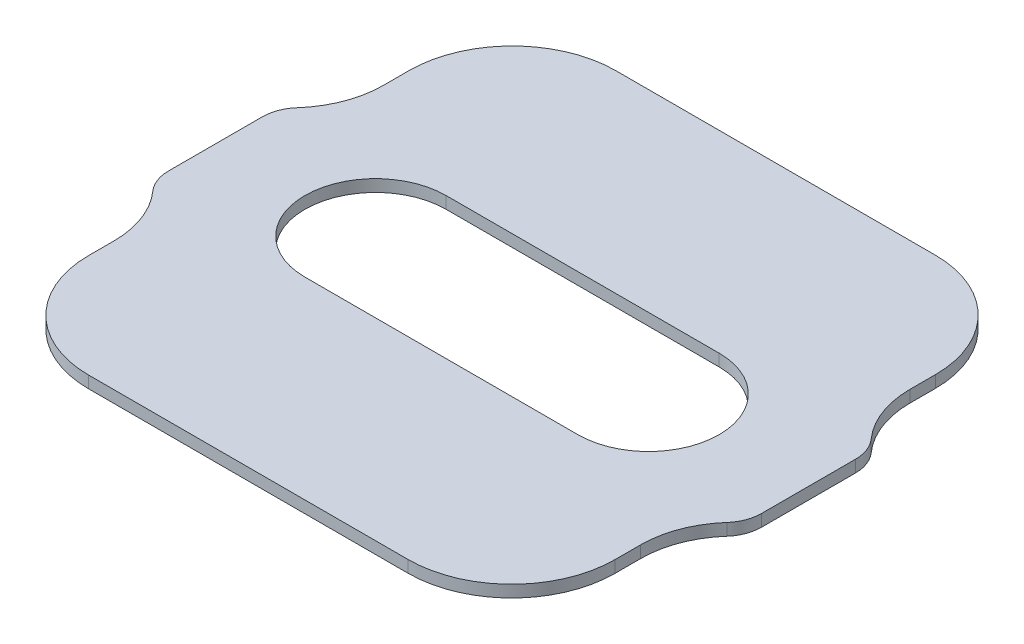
ISO-10303-21;
HEADER;
FILE_DESCRIPTION(('STEP AP214'),'2;1');
FILE_NAME('part.step','',(''),(''),'','','');
FILE_SCHEMA(('AUTOMOTIVE_DESIGN { 1 0 10303 214 1 1 1 1 }'));
ENDSEC;
DATA;
#1=APPLICATION_CONTEXT('core data for automotive mechanical design processes');
#2=APPLICATION_PROTOCOL_DEFINITION('international standard','automotive_design',2000,#1);
#3=PRODUCT_CONTEXT('',#1,'mechanical');
#4=PRODUCT('Part','Part','',(#3));
#5=PRODUCT_RELATED_PRODUCT_CATEGORY('part','',(#4));
#6=PRODUCT_DEFINITION_FORMATION('','',#4);
#7=PRODUCT_DEFINITION_CONTEXT('part definition',#1,'design');
#8=PRODUCT_DEFINITION('design','',#6,#7);
#9=PRODUCT_DEFINITION_SHAPE('','',#8);
#10=(LENGTH_UNIT() NAMED_UNIT(*) SI_UNIT(.MILLI.,.METRE.));
#11=(NAMED_UNIT(*) PLANE_ANGLE_UNIT() SI_UNIT($,.RADIAN.));
#12=(NAMED_UNIT(*) SI_UNIT($,.STERADIAN.) SOLID_ANGLE_UNIT());
#13=UNCERTAINTY_MEASURE_WITH_UNIT(LENGTH_MEASURE(1.E-05),#10,'distance_accuracy_value','');
#14=(GEOMETRIC_REPRESENTATION_CONTEXT(3) GLOBAL_UNCERTAINTY_ASSIGNED_CONTEXT((#13)) GLOBAL_UNIT_ASSIGNED_CONTEXT((#10,
#11,#12)) REPRESENTATION_CONTEXT('',''));
#15=CARTESIAN_POINT('',(0.,0.,0.));
#16=DIRECTION('',(0.,0.,1.));
#17=DIRECTION('',(1.,0.,0.));
#18=AXIS2_PLACEMENT_3D('',#15,#16,#17);
#19=CARTESIAN_POINT('',(16.1952754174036,0.127,5.33075165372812));
#20=DIRECTION('',(0.,-1.,0.));
#21=DIRECTION('',(0.,0.,-1.));
#22=AXIS2_PLACEMENT_3D('',#19,#20,#21);
#23=CYLINDRICAL_SURFACE('',#22,0.400000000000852);
#24=CARTESIAN_POINT('',(16.1952754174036,0.,5.33075165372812));
#25=DIRECTION('',(0.,1.,0.));
#26=DIRECTION('',(0.,0.,1.));
#27=AXIS2_PLACEMENT_3D('',#24,#25,#26);
#28=CIRCLE('',#27,0.400000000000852);
#29=CARTESIAN_POINT('',(15.8963417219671,0.,5.06497233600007));
#30=VERTEX_POINT('',#29);
#31=CARTESIAN_POINT('',(15.7952754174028,0.,5.33075165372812));
#32=VERTEX_POINT('',#31);
#33=EDGE_CURVE('E230',#30,#32,#28,.T.);
#34=ORIENTED_EDGE('',*,*,#33,.T.);
#35=DIRECTION('',(0.,-1.,0.));
#36=VECTOR('',#35,1.);
#37=CARTESIAN_POINT('',(15.7952754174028,0.127,5.33075165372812));
#38=LINE('',#37,#36);
#39=CARTESIAN_POINT('',(15.7952754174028,0.127,5.33075165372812));
#40=VERTEX_POINT('',#39);
#41=EDGE_CURVE('E11',#40,#32,#38,.T.);
#42=ORIENTED_EDGE('',*,*,#41,.F.);
#43=CARTESIAN_POINT('',(16.1952754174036,0.127,5.33075165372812));
#44=DIRECTION('',(0.,1.,0.));
#45=DIRECTION('',(0.,0.,1.));
#46=AXIS2_PLACEMENT_3D('',#43,#44,#45);
#47=CIRCLE('',#46,0.400000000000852);
#48=CARTESIAN_POINT('',(15.8963417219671,0.127,5.06497233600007));
#49=VERTEX_POINT('',#48);
#50=EDGE_CURVE('E234',#49,#40,#47,.T.);
#51=ORIENTED_EDGE('',*,*,#50,.F.);
#52=DIRECTION('',(0.,-1.,0.));
#53=VECTOR('',#52,1.);
#54=CARTESIAN_POINT('',(15.8963417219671,0.127,5.06497233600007));
#55=LINE('',#54,#53);
#56=EDGE_CURVE('E276',#49,#30,#55,.T.);
#57=ORIENTED_EDGE('',*,*,#56,.T.);
#58=EDGE_LOOP('',(#34,#42,#51,#57));
#59=FACE_BOUND('',#58,.T.);
#60=ADVANCED_FACE('F37',(#59),#23,.T.);
#61=CARTESIAN_POINT('',(15.7952754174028,0.127,5.33075165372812));
#62=DIRECTION('',(1.,0.,0.));
#63=DIRECTION('',(0.,0.,-1.));
#64=AXIS2_PLACEMENT_3D('',#61,#62,#63);
#65=PLANE('',#64);
#66=DIRECTION('',(0.,0.,1.));
#67=VECTOR('',#66,1.);
#68=CARTESIAN_POINT('',(15.7952754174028,0.,5.33075165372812));
#69=LINE('',#68,#67);
#70=CARTESIAN_POINT('',(15.7952754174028,0.,6.33075165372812));
#71=VERTEX_POINT('',#70);
#72=EDGE_CURVE('E279',#32,#71,#69,.T.);
#73=ORIENTED_EDGE('',*,*,#72,.T.);
#74=DIRECTION('',(0.,-1.,0.));
#75=VECTOR('',#74,1.);
#76=CARTESIAN_POINT('',(15.7952754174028,0.127,6.33075165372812));
#77=LINE('',#76,#75);
#78=CARTESIAN_POINT('',(15.7952754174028,0.127,6.33075165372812));
#79=VERTEX_POINT('',#78);
#80=EDGE_CURVE('E44',#79,#71,#77,.T.);
#81=ORIENTED_EDGE('',*,*,#80,.F.);
#82=DIRECTION('',(0.,0.,1.));
#83=VECTOR('',#82,1.);
#84=CARTESIAN_POINT('',(15.7952754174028,0.127,5.33075165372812));
#85=LINE('',#84,#83);
#86=EDGE_CURVE('E237',#40,#79,#85,.T.);
#87=ORIENTED_EDGE('',*,*,#86,.F.);
#88=ORIENTED_EDGE('',*,*,#41,.T.);
#89=EDGE_LOOP('',(#73,#81,#87,#88));
#90=FACE_BOUND('',#89,.T.);
#91=ADVANCED_FACE('F394',(#90),#65,.F.);
#92=CARTESIAN_POINT('',(16.1952754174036,0.127,6.33075165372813));
#93=DIRECTION('',(0.,-1.,0.));
#94=DIRECTION('',(0.,0.,-1.));
#95=AXIS2_PLACEMENT_3D('',#92,#93,#94);
#96=CYLINDRICAL_SURFACE('',#95,0.400000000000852);
#97=CARTESIAN_POINT('',(16.1952754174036,0.,6.33075165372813));
#98=DIRECTION('',(0.,1.,0.));
#99=DIRECTION('',(0.,0.,-1.));
#100=AXIS2_PLACEMENT_3D('',#97,#98,#99);
#101=CIRCLE('',#100,0.400000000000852);
#102=CARTESIAN_POINT('',(15.8963417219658,0.,6.59653097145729));
#103=VERTEX_POINT('',#102);
#104=EDGE_CURVE('E281',#71,#103,#101,.T.);
#105=ORIENTED_EDGE('',*,*,#104,.T.);
#106=DIRECTION('',(0.,-1.,0.));
#107=VECTOR('',#106,1.);
#108=CARTESIAN_POINT('',(15.8963417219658,0.127,6.59653097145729));
#109=LINE('',#108,#107);
#110=CARTESIAN_POINT('',(15.8963417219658,0.127,6.59653097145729));
#111=VERTEX_POINT('',#110);
#112=EDGE_CURVE('E366',#111,#103,#109,.T.);
#113=ORIENTED_EDGE('',*,*,#112,.F.);
#114=CARTESIAN_POINT('',(16.1952754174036,0.127,6.33075165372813));
#115=DIRECTION('',(0.,1.,0.));
#116=DIRECTION('',(0.,0.,-1.));
#117=AXIS2_PLACEMENT_3D('',#114,#115,#116);
#118=CIRCLE('',#117,0.400000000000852);
#119=EDGE_CURVE('E240',#79,#111,#118,.T.);
#120=ORIENTED_EDGE('',*,*,#119,.F.);
#121=ORIENTED_EDGE('',*,*,#80,.T.);
#122=EDGE_LOOP('',(#105,#113,#120,#121));
#123=FACE_BOUND('',#122,.T.);
#124=ADVANCED_FACE('F373',(#123),#96,.T.);
#125=CARTESIAN_POINT('',(15.149007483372,0.127,7.2609792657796));
#126=DIRECTION('',(0.,-1.,0.));
#127=DIRECTION('',(0.,0.,-1.));
#128=AXIS2_PLACEMENT_3D('',#125,#126,#127);
#129=CYLINDRICAL_SURFACE('',#128,1.00000000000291);
#130=CARTESIAN_POINT('',(15.149007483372,0.,7.2609792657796));
#131=DIRECTION('',(0.,-1.,0.));
#132=DIRECTION('',(0.,0.,1.));
#133=AXIS2_PLACEMENT_3D('',#130,#131,#132);
#134=CIRCLE('',#133,1.00000000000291);
#135=CARTESIAN_POINT('',(16.1490074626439,0.,7.26077564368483));
#136=VERTEX_POINT('',#135);
#137=EDGE_CURVE('E283',#103,#136,#134,.T.);
#138=ORIENTED_EDGE('',*,*,#137,.T.);
#139=DIRECTION('',(0.,-1.,0.));
#140=VECTOR('',#139,1.);
#141=CARTESIAN_POINT('',(16.1490074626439,0.127,7.26077564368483));
#142=LINE('',#141,#140);
#143=CARTESIAN_POINT('',(16.1490074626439,0.127,7.26077564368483));
#144=VERTEX_POINT('',#143);
#145=EDGE_CURVE('E363',#144,#136,#142,.T.);
#146=ORIENTED_EDGE('',*,*,#145,.F.);
#147=CARTESIAN_POINT('',(15.149007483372,0.127,7.2609792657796));
#148=DIRECTION('',(0.,-1.,0.));
#149=DIRECTION('',(0.,0.,1.));
#150=AXIS2_PLACEMENT_3D('',#147,#148,#149);
#151=CIRCLE('',#150,1.00000000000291);
#152=EDGE_CURVE('E242',#111,#144,#151,.T.);
#153=ORIENTED_EDGE('',*,*,#152,.F.);
#154=ORIENTED_EDGE('',*,*,#112,.T.);
#155=EDGE_LOOP('',(#138,#146,#153,#154));
#156=FACE_BOUND('',#155,.T.);
#157=ADVANCED_FACE('F382',(#156),#129,.F.);
#158=CARTESIAN_POINT('',(16.1490624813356,0.127,7.53097563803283));
#159=DIRECTION('',(0.999999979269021,0.,-0.00020362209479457));
#160=DIRECTION('',(-0.00020362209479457,0.,-0.999999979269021));
#161=AXIS2_PLACEMENT_3D('',#158,#159,#160);
#162=PLANE('',#161);
#163=DIRECTION('',(0.00020362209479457,0.,0.999999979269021));
#164=VECTOR('',#163,1.);
#165=CARTESIAN_POINT('',(16.1490624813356,0.,7.53097563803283));
#166=LINE('',#165,#164);
#167=CARTESIAN_POINT('',(16.1490624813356,0.,7.53097563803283));
#168=VERTEX_POINT('',#167);
#169=EDGE_CURVE('E285',#136,#168,#166,.T.);
#170=ORIENTED_EDGE('',*,*,#169,.T.);
#171=DIRECTION('',(0.,-1.,0.));
#172=VECTOR('',#171,1.);
#173=CARTESIAN_POINT('',(16.1490624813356,0.127,7.53097563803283));
#174=LINE('',#173,#172);
#175=CARTESIAN_POINT('',(16.1490624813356,0.127,7.53097563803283));
#176=VERTEX_POINT('',#175);
#177=EDGE_CURVE('E360',#176,#168,#174,.T.);
#178=ORIENTED_EDGE('',*,*,#177,.F.);
#179=DIRECTION('',(0.00020362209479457,0.,0.999999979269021));
#180=VECTOR('',#179,1.);
#181=CARTESIAN_POINT('',(16.1490624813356,0.127,7.53097563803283));
#182=LINE('',#181,#180);
#183=EDGE_CURVE('E244',#144,#176,#182,.T.);
#184=ORIENTED_EDGE('',*,*,#183,.F.);
#185=ORIENTED_EDGE('',*,*,#145,.T.);
#186=EDGE_LOOP('',(#170,#178,#184,#185));
#187=FACE_BOUND('',#186,.T.);
#188=ADVANCED_FACE('F386',(#187),#162,.F.);
#189=CARTESIAN_POINT('',(17.2490624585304,0.127,7.53075165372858));
#190=DIRECTION('',(0.,-1.,0.));
#191=DIRECTION('',(0.,0.,-1.));
#192=AXIS2_PLACEMENT_3D('',#189,#190,#191);
#193=CYLINDRICAL_SURFACE('',#192,1.10000000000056);
#194=CARTESIAN_POINT('',(17.2490624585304,0.,7.53075165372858));
#195=DIRECTION('',(0.,1.,0.));
#196=DIRECTION('',(0.,0.,-1.));
#197=AXIS2_PLACEMENT_3D('',#194,#195,#196);
#198=CIRCLE('',#197,1.10000000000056);
#199=CARTESIAN_POINT('',(17.2490624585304,0.,8.63075165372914));
#200=VERTEX_POINT('',#199);
#201=EDGE_CURVE('E287',#168,#200,#198,.T.);
#202=ORIENTED_EDGE('',*,*,#201,.T.);
#203=DIRECTION('',(0.,-1.,0.));
#204=VECTOR('',#203,1.);
#205=CARTESIAN_POINT('',(17.2490624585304,0.127,8.63075165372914));
#206=LINE('',#205,#204);
#207=CARTESIAN_POINT('',(17.2490624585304,0.127,8.63075165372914));
#208=VERTEX_POINT('',#207);
#209=EDGE_CURVE('E357',#208,#200,#206,.T.);
#210=ORIENTED_EDGE('',*,*,#209,.F.);
#211=CARTESIAN_POINT('',(17.2490624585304,0.127,7.53075165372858));
#212=DIRECTION('',(0.,1.,0.));
#213=DIRECTION('',(0.,0.,-1.));
#214=AXIS2_PLACEMENT_3D('',#211,#212,#213);
#215=CIRCLE('',#214,1.10000000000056);
#216=EDGE_CURVE('E246',#176,#208,#215,.T.);
#217=ORIENTED_EDGE('',*,*,#216,.F.);
#218=ORIENTED_EDGE('',*,*,#177,.T.);
#219=EDGE_LOOP('',(#202,#210,#217,#218));
#220=FACE_BOUND('',#219,.T.);
#221=ADVANCED_FACE('F467',(#220),#193,.T.);
#222=CARTESIAN_POINT('',(20.6414883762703,0.127,8.63075165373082));
#223=DIRECTION('',(0.,0.,-1.));
#224=DIRECTION('',(-1.,0.,0.));
#225=AXIS2_PLACEMENT_3D('',#222,#223,#224);
#226=PLANE('',#225);
#227=DIRECTION('',(1.,0.,0.));
#228=VECTOR('',#227,1.);
#229=CARTESIAN_POINT('',(20.6414883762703,0.,8.63075165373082));
#230=LINE('',#229,#228);
#231=CARTESIAN_POINT('',(20.6414883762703,0.,8.63075165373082));
#232=VERTEX_POINT('',#231);
#233=EDGE_CURVE('E289',#200,#232,#230,.T.);
#234=ORIENTED_EDGE('',*,*,#233,.T.);
#235=DIRECTION('',(0.,-1.,0.));
#236=VECTOR('',#235,1.);
#237=CARTESIAN_POINT('',(20.6414883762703,0.127,8.63075165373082));
#238=LINE('',#237,#236);
#239=CARTESIAN_POINT('',(20.6414883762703,0.127,8.63075165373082));
#240=VERTEX_POINT('',#239);
#241=EDGE_CURVE('E354',#240,#232,#238,.T.);
#242=ORIENTED_EDGE('',*,*,#241,.F.);
#243=DIRECTION('',(1.,0.,0.));
#244=VECTOR('',#243,1.);
#245=CARTESIAN_POINT('',(20.6414883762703,0.127,8.63075165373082));
#246=LINE('',#245,#244);
#247=EDGE_CURVE('E248',#208,#240,#246,.T.);
#248=ORIENTED_EDGE('',*,*,#247,.F.);
#249=ORIENTED_EDGE('',*,*,#209,.T.);
#250=EDGE_LOOP('',(#234,#242,#248,#249));
#251=FACE_BOUND('',#250,.T.);
#252=ADVANCED_FACE('F465',(#251),#226,.F.);
#253=CARTESIAN_POINT('',(20.6414883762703,0.127,7.53075165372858));
#254=DIRECTION('',(0.,-1.,0.));
#255=DIRECTION('',(0.,0.,-1.));
#256=AXIS2_PLACEMENT_3D('',#253,#254,#255);
#257=CYLINDRICAL_SURFACE('',#256,1.10000000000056);
#258=CARTESIAN_POINT('',(20.6414883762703,0.,7.53075165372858));
#259=DIRECTION('',(0.,1.,0.));
#260=DIRECTION('',(0.,0.,1.));
#261=AXIS2_PLACEMENT_3D('',#258,#259,#260);
#262=CIRCLE('',#261,1.10000000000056);
#263=CARTESIAN_POINT('',(21.7414883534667,0.,7.53097563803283));
#264=VERTEX_POINT('',#263);
#265=EDGE_CURVE('E291',#232,#264,#262,.T.);
#266=ORIENTED_EDGE('',*,*,#265,.T.);
#267=DIRECTION('',(0.,-1.,0.));
#268=VECTOR('',#267,1.);
#269=CARTESIAN_POINT('',(21.7414883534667,0.127,7.53097563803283));
#270=LINE('',#269,#268);
#271=CARTESIAN_POINT('',(21.7414883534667,0.127,7.53097563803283));
#272=VERTEX_POINT('',#271);
#273=EDGE_CURVE('E351',#272,#264,#270,.T.);
#274=ORIENTED_EDGE('',*,*,#273,.F.);
#275=CARTESIAN_POINT('',(20.6414883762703,0.127,7.53075165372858));
#276=DIRECTION('',(0.,1.,0.));
#277=DIRECTION('',(0.,0.,1.));
#278=AXIS2_PLACEMENT_3D('',#275,#276,#277);
#279=CIRCLE('',#278,1.10000000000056);
#280=EDGE_CURVE('E250',#240,#272,#279,.T.);
#281=ORIENTED_EDGE('',*,*,#280,.F.);
#282=ORIENTED_EDGE('',*,*,#241,.T.);
#283=EDGE_LOOP('',(#266,#274,#281,#282));
#284=FACE_BOUND('',#283,.T.);
#285=ADVANCED_FACE('F460',(#284),#257,.T.);
#286=CARTESIAN_POINT('',(21.7414883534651,0.127,7.53097563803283));
#287=DIRECTION('',(-0.999999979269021,0.,-0.00020362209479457));
#288=DIRECTION('',(-0.00020362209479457,0.,0.999999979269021));
#289=AXIS2_PLACEMENT_3D('',#286,#287,#288);
#290=PLANE('',#289);
#291=DIRECTION('',(0.00020362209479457,0.,-0.999999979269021));
#292=VECTOR('',#291,1.);
#293=CARTESIAN_POINT('',(21.7414883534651,0.,7.53097563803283));
#294=LINE('',#293,#292);
#295=CARTESIAN_POINT('',(21.7415433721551,0.,7.26077564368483));
#296=VERTEX_POINT('',#295);
#297=EDGE_CURVE('E293',#264,#296,#294,.T.);
#298=ORIENTED_EDGE('',*,*,#297,.T.);
#299=DIRECTION('',(0.,-1.,0.));
#300=VECTOR('',#299,1.);
#301=CARTESIAN_POINT('',(21.7415433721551,0.127,7.26077564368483));
#302=LINE('',#301,#300);
#303=CARTESIAN_POINT('',(21.7415433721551,0.127,7.26077564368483));
#304=VERTEX_POINT('',#303);
#305=EDGE_CURVE('E348',#304,#296,#302,.T.);
#306=ORIENTED_EDGE('',*,*,#305,.F.);
#307=DIRECTION('',(0.00020362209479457,0.,-0.999999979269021));
#308=VECTOR('',#307,1.);
#309=CARTESIAN_POINT('',(21.7414883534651,0.127,7.53097563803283));
#310=LINE('',#309,#308);
#311=EDGE_CURVE('E252',#272,#304,#310,.T.);
#312=ORIENTED_EDGE('',*,*,#311,.F.);
#313=ORIENTED_EDGE('',*,*,#273,.T.);
#314=EDGE_LOOP('',(#298,#306,#312,#313));
#315=FACE_BOUND('',#314,.T.);
#316=ADVANCED_FACE('F455',(#315),#290,.F.);
#317=CARTESIAN_POINT('',(22.7415433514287,0.127,7.2609792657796));
#318=DIRECTION('',(0.,-1.,0.));
#319=DIRECTION('',(0.,0.,-1.));
#320=AXIS2_PLACEMENT_3D('',#317,#318,#319);
#321=CYLINDRICAL_SURFACE('',#320,1.00000000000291);
#322=CARTESIAN_POINT('',(22.7415433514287,0.,7.2609792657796));
#323=DIRECTION('',(0.,-1.,0.));
#324=DIRECTION('',(0.,0.,-1.));
#325=AXIS2_PLACEMENT_3D('',#322,#323,#324);
#326=CIRCLE('',#325,1.00000000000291);
#327=CARTESIAN_POINT('',(21.9942091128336,0.,6.59653097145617));
#328=VERTEX_POINT('',#327);
#329=EDGE_CURVE('E295',#296,#328,#326,.T.);
#330=ORIENTED_EDGE('',*,*,#329,.T.);
#331=DIRECTION('',(0.,-1.,0.));
#332=VECTOR('',#331,1.);
#333=CARTESIAN_POINT('',(21.9942091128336,0.127,6.59653097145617));
#334=LINE('',#333,#332);
#335=CARTESIAN_POINT('',(21.9942091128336,0.127,6.59653097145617));
#336=VERTEX_POINT('',#335);
#337=EDGE_CURVE('E345',#336,#328,#334,.T.);
#338=ORIENTED_EDGE('',*,*,#337,.F.);
#339=CARTESIAN_POINT('',(22.7415433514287,0.127,7.2609792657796));
#340=DIRECTION('',(0.,-1.,0.));
#341=DIRECTION('',(0.,0.,-1.));
#342=AXIS2_PLACEMENT_3D('',#339,#340,#341);
#343=CIRCLE('',#342,1.00000000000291);
#344=EDGE_CURVE('E254',#304,#336,#343,.T.);
#345=ORIENTED_EDGE('',*,*,#344,.F.);
#346=ORIENTED_EDGE('',*,*,#305,.T.);
#347=EDGE_LOOP('',(#330,#338,#345,#346));
#348=FACE_BOUND('',#347,.T.);
#349=ADVANCED_FACE('F451',(#348),#321,.F.);
#350=CARTESIAN_POINT('',(21.695275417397,0.127,6.33075165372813));
#351=DIRECTION('',(0.,-1.,0.));
#352=DIRECTION('',(0.,0.,-1.));
#353=AXIS2_PLACEMENT_3D('',#350,#351,#352);
#354=CYLINDRICAL_SURFACE('',#353,0.400000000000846);
#355=CARTESIAN_POINT('',(21.695275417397,0.,6.33075165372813));
#356=DIRECTION('',(0.,1.,0.));
#357=DIRECTION('',(0.,0.,1.));
#358=AXIS2_PLACEMENT_3D('',#355,#356,#357);
#359=CIRCLE('',#358,0.400000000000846);
#360=CARTESIAN_POINT('',(22.0952754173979,0.,6.33075165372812));
#361=VERTEX_POINT('',#360);
#362=EDGE_CURVE('E297',#328,#361,#359,.T.);
#363=ORIENTED_EDGE('',*,*,#362,.T.);
#364=DIRECTION('',(0.,-1.,0.));
#365=VECTOR('',#364,1.);
#366=CARTESIAN_POINT('',(22.0952754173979,0.127,6.33075165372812));
#367=LINE('',#366,#365);
#368=CARTESIAN_POINT('',(22.0952754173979,0.127,6.33075165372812));
#369=VERTEX_POINT('',#368);
#370=EDGE_CURVE('E342',#369,#361,#367,.T.);
#371=ORIENTED_EDGE('',*,*,#370,.F.);
#372=CARTESIAN_POINT('',(21.695275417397,0.127,6.33075165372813));
#373=DIRECTION('',(0.,1.,0.));
#374=DIRECTION('',(0.,0.,1.));
#375=AXIS2_PLACEMENT_3D('',#372,#373,#374);
#376=CIRCLE('',#375,0.400000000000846);
#377=EDGE_CURVE('E256',#336,#369,#376,.T.);
#378=ORIENTED_EDGE('',*,*,#377,.F.);
#379=ORIENTED_EDGE('',*,*,#337,.T.);
#380=EDGE_LOOP('',(#363,#371,#378,#379));
#381=FACE_BOUND('',#380,.T.);
#382=ADVANCED_FACE('F446',(#381),#354,.T.);
#383=CARTESIAN_POINT('',(22.0952754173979,0.127,5.33075165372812));
#384=DIRECTION('',(-1.,0.,0.));
#385=DIRECTION('',(0.,0.,1.));
#386=AXIS2_PLACEMENT_3D('',#383,#384,#385);
#387=PLANE('',#386);
#388=DIRECTION('',(0.,0.,-1.));
#389=VECTOR('',#388,1.);
#390=CARTESIAN_POINT('',(22.0952754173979,0.,5.33075165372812));
#391=LINE('',#390,#389);
#392=CARTESIAN_POINT('',(22.0952754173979,0.,5.33075165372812));
#393=VERTEX_POINT('',#392);
#394=EDGE_CURVE('E299',#361,#393,#391,.T.);
#395=ORIENTED_EDGE('',*,*,#394,.T.);
#396=DIRECTION('',(0.,-1.,0.));
#397=VECTOR('',#396,1.);
#398=CARTESIAN_POINT('',(22.0952754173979,0.127,5.33075165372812));
#399=LINE('',#398,#397);
#400=CARTESIAN_POINT('',(22.0952754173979,0.127,5.33075165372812));
#401=VERTEX_POINT('',#400);
#402=EDGE_CURVE('E339',#401,#393,#399,.T.);
#403=ORIENTED_EDGE('',*,*,#402,.F.);
#404=DIRECTION('',(0.,0.,-1.));
#405=VECTOR('',#404,1.);
#406=CARTESIAN_POINT('',(22.0952754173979,0.127,5.33075165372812));
#407=LINE('',#406,#405);
#408=EDGE_CURVE('E258',#369,#401,#407,.T.);
#409=ORIENTED_EDGE('',*,*,#408,.F.);
#410=ORIENTED_EDGE('',*,*,#370,.T.);
#411=EDGE_LOOP('',(#395,#403,#409,#410));
#412=FACE_BOUND('',#411,.T.);
#413=ADVANCED_FACE('F440',(#412),#387,.F.);
#414=CARTESIAN_POINT('',(21.695275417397,0.127,5.33075165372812));
#415=DIRECTION('',(0.,-1.,0.));
#416=DIRECTION('',(0.,0.,-1.));
#417=AXIS2_PLACEMENT_3D('',#414,#415,#416);
#418=CYLINDRICAL_SURFACE('',#417,0.400000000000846);
#419=CARTESIAN_POINT('',(21.695275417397,0.,5.33075165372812));
#420=DIRECTION('',(0.,1.,0.));
#421=DIRECTION('',(0.,0.,-1.));
#422=AXIS2_PLACEMENT_3D('',#419,#420,#421);
#423=CIRCLE('',#422,0.400000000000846);
#424=CARTESIAN_POINT('',(21.9942091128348,0.,5.06497233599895));
#425=VERTEX_POINT('',#424);
#426=EDGE_CURVE('E301',#393,#425,#423,.T.);
#427=ORIENTED_EDGE('',*,*,#426,.T.);
#428=DIRECTION('',(0.,-1.,0.));
#429=VECTOR('',#428,1.);
#430=CARTESIAN_POINT('',(21.9942091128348,0.127,5.06497233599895));
#431=LINE('',#430,#429);
#432=CARTESIAN_POINT('',(21.9942091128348,0.127,5.06497233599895));
#433=VERTEX_POINT('',#432);
#434=EDGE_CURVE('E336',#433,#425,#431,.T.);
#435=ORIENTED_EDGE('',*,*,#434,.F.);
#436=CARTESIAN_POINT('',(21.695275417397,0.127,5.33075165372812));
#437=DIRECTION('',(0.,1.,0.));
#438=DIRECTION('',(0.,0.,-1.));
#439=AXIS2_PLACEMENT_3D('',#436,#437,#438);
#440=CIRCLE('',#439,0.400000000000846);
#441=EDGE_CURVE('E260',#401,#433,#440,.T.);
#442=ORIENTED_EDGE('',*,*,#441,.F.);
#443=ORIENTED_EDGE('',*,*,#402,.T.);
#444=EDGE_LOOP('',(#427,#435,#442,#443));
#445=FACE_BOUND('',#444,.T.);
#446=ADVANCED_FACE('F436',(#445),#418,.T.);
#447=CARTESIAN_POINT('',(22.7415433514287,0.127,4.40052404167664));
#448=DIRECTION('',(0.,-1.,0.));
#449=DIRECTION('',(0.,0.,-1.));
#450=AXIS2_PLACEMENT_3D('',#447,#448,#449);
#451=CYLINDRICAL_SURFACE('',#450,1.00000000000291);
#452=CARTESIAN_POINT('',(22.7415433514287,0.,4.40052404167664));
#453=DIRECTION('',(0.,-1.,0.));
#454=DIRECTION('',(0.,0.,1.));
#455=AXIS2_PLACEMENT_3D('',#452,#453,#454);
#456=CIRCLE('',#455,1.00000000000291);
#457=CARTESIAN_POINT('',(21.7415433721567,0.,4.40072766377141));
#458=VERTEX_POINT('',#457);
#459=EDGE_CURVE('E303',#425,#458,#456,.T.);
#460=ORIENTED_EDGE('',*,*,#459,.T.);
#461=DIRECTION('',(0.,-1.,0.));
#462=VECTOR('',#461,1.);
#463=CARTESIAN_POINT('',(21.7415433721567,0.127,4.40072766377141));
#464=LINE('',#463,#462);
#465=CARTESIAN_POINT('',(21.7415433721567,0.127,4.40072766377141));
#466=VERTEX_POINT('',#465);
#467=EDGE_CURVE('E333',#466,#458,#464,.T.);
#468=ORIENTED_EDGE('',*,*,#467,.F.);
#469=CARTESIAN_POINT('',(22.7415433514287,0.127,4.40052404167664));
#470=DIRECTION('',(0.,-1.,0.));
#471=DIRECTION('',(0.,0.,1.));
#472=AXIS2_PLACEMENT_3D('',#469,#470,#471);
#473=CIRCLE('',#472,1.00000000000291);
#474=EDGE_CURVE('E262',#433,#466,#473,.T.);
#475=ORIENTED_EDGE('',*,*,#474,.F.);
#476=ORIENTED_EDGE('',*,*,#434,.T.);
#477=EDGE_LOOP('',(#460,#468,#475,#476));
#478=FACE_BOUND('',#477,.T.);
#479=ADVANCED_FACE('F431',(#478),#451,.F.);
#480=CARTESIAN_POINT('',(21.7414883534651,0.127,4.13052766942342));
#481=DIRECTION('',(-0.999999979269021,0.,0.00020362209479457));
#482=DIRECTION('',(0.00020362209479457,0.,0.999999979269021));
#483=AXIS2_PLACEMENT_3D('',#480,#481,#482);
#484=PLANE('',#483);
#485=DIRECTION('',(-0.00020362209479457,0.,-0.999999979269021));
#486=VECTOR('',#485,1.);
#487=CARTESIAN_POINT('',(21.7414883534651,0.,4.13052766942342));
#488=LINE('',#487,#486);
#489=CARTESIAN_POINT('',(21.7414883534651,0.,4.13052766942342));
#490=VERTEX_POINT('',#489);
#491=EDGE_CURVE('E305',#458,#490,#488,.T.);
#492=ORIENTED_EDGE('',*,*,#491,.T.);
#493=DIRECTION('',(0.,-1.,0.));
#494=VECTOR('',#493,1.);
#495=CARTESIAN_POINT('',(21.7414883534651,0.127,4.13052766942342));
#496=LINE('',#495,#494);
#497=CARTESIAN_POINT('',(21.7414883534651,0.127,4.13052766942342));
#498=VERTEX_POINT('',#497);
#499=EDGE_CURVE('E330',#498,#490,#496,.T.);
#500=ORIENTED_EDGE('',*,*,#499,.F.);
#501=DIRECTION('',(-0.00020362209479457,0.,-0.999999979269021));
#502=VECTOR('',#501,1.);
#503=CARTESIAN_POINT('',(21.7414883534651,0.127,4.13052766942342));
#504=LINE('',#503,#502);
#505=EDGE_CURVE('E264',#466,#498,#504,.T.);
#506=ORIENTED_EDGE('',*,*,#505,.F.);
#507=ORIENTED_EDGE('',*,*,#467,.T.);
#508=EDGE_LOOP('',(#492,#500,#506,#507));
#509=FACE_BOUND('',#508,.T.);
#510=ADVANCED_FACE('F425',(#509),#484,.F.);
#511=CARTESIAN_POINT('',(20.6414883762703,0.127,4.13075165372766));
#512=DIRECTION('',(0.,-1.,0.));
#513=DIRECTION('',(0.,0.,-1.));
#514=AXIS2_PLACEMENT_3D('',#511,#512,#513);
#515=CYLINDRICAL_SURFACE('',#514,1.10000000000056);
#516=CARTESIAN_POINT('',(20.6414883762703,0.,4.13075165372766));
#517=DIRECTION('',(0.,1.,0.));
#518=DIRECTION('',(0.,0.,-1.));
#519=AXIS2_PLACEMENT_3D('',#516,#517,#518);
#520=CIRCLE('',#519,1.10000000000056);
#521=CARTESIAN_POINT('',(20.6414883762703,0.,3.0307516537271));
#522=VERTEX_POINT('',#521);
#523=EDGE_CURVE('E307',#490,#522,#520,.T.);
#524=ORIENTED_EDGE('',*,*,#523,.T.);
#525=DIRECTION('',(0.,-1.,0.));
#526=VECTOR('',#525,1.);
#527=CARTESIAN_POINT('',(20.6414883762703,0.127,3.0307516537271));
#528=LINE('',#527,#526);
#529=CARTESIAN_POINT('',(20.6414883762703,0.127,3.0307516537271));
#530=VERTEX_POINT('',#529);
#531=EDGE_CURVE('E327',#530,#522,#528,.T.);
#532=ORIENTED_EDGE('',*,*,#531,.F.);
#533=CARTESIAN_POINT('',(20.6414883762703,0.127,4.13075165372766));
#534=DIRECTION('',(0.,1.,0.));
#535=DIRECTION('',(0.,0.,-1.));
#536=AXIS2_PLACEMENT_3D('',#533,#534,#535);
#537=CIRCLE('',#536,1.10000000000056);
#538=EDGE_CURVE('E266',#498,#530,#537,.T.);
#539=ORIENTED_EDGE('',*,*,#538,.F.);
#540=ORIENTED_EDGE('',*,*,#499,.T.);
#541=EDGE_LOOP('',(#524,#532,#539,#540));
#542=FACE_BOUND('',#541,.T.);
#543=ADVANCED_FACE('F421',(#542),#515,.T.);
#544=CARTESIAN_POINT('',(20.6414883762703,0.127,3.03075165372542));
#545=DIRECTION('',(0.,0.,1.));
#546=DIRECTION('',(1.,0.,0.));
#547=AXIS2_PLACEMENT_3D('',#544,#545,#546);
#548=PLANE('',#547);
#549=DIRECTION('',(-1.,0.,0.));
#550=VECTOR('',#549,1.);
#551=CARTESIAN_POINT('',(20.6414883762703,0.,3.03075165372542));
#552=LINE('',#551,#550);
#553=CARTESIAN_POINT('',(17.2490624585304,0.,3.03075165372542));
#554=VERTEX_POINT('',#553);
#555=EDGE_CURVE('E309',#522,#554,#552,.T.);
#556=ORIENTED_EDGE('',*,*,#555,.T.);
#557=DIRECTION('',(0.,-1.,0.));
#558=VECTOR('',#557,1.);
#559=CARTESIAN_POINT('',(17.2490624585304,0.127,3.03075165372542));
#560=LINE('',#559,#558);
#561=CARTESIAN_POINT('',(17.2490624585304,0.127,3.03075165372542));
#562=VERTEX_POINT('',#561);
#563=EDGE_CURVE('E324',#562,#554,#560,.T.);
#564=ORIENTED_EDGE('',*,*,#563,.F.);
#565=DIRECTION('',(-1.,0.,0.));
#566=VECTOR('',#565,1.);
#567=CARTESIAN_POINT('',(20.6414883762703,0.127,3.03075165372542));
#568=LINE('',#567,#566);
#569=EDGE_CURVE('E268',#530,#562,#568,.T.);
#570=ORIENTED_EDGE('',*,*,#569,.F.);
#571=ORIENTED_EDGE('',*,*,#531,.T.);
#572=EDGE_LOOP('',(#556,#564,#570,#571));
#573=FACE_BOUND('',#572,.T.);
#574=ADVANCED_FACE('F416',(#573),#548,.F.);
#575=CARTESIAN_POINT('',(17.2490624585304,0.127,4.13075165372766));
#576=DIRECTION('',(0.,-1.,0.));
#577=DIRECTION('',(0.,0.,-1.));
#578=AXIS2_PLACEMENT_3D('',#575,#576,#577);
#579=CYLINDRICAL_SURFACE('',#578,1.10000000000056);
#580=CARTESIAN_POINT('',(17.2490624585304,0.,4.13075165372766));
#581=DIRECTION('',(0.,1.,0.));
#582=DIRECTION('',(0.,0.,1.));
#583=AXIS2_PLACEMENT_3D('',#580,#581,#582);
#584=CIRCLE('',#583,1.10000000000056);
#585=CARTESIAN_POINT('',(16.1490624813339,0.,4.13052766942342));
#586=VERTEX_POINT('',#585);
#587=EDGE_CURVE('E311',#554,#586,#584,.T.);
#588=ORIENTED_EDGE('',*,*,#587,.T.);
#589=DIRECTION('',(0.,-1.,0.));
#590=VECTOR('',#589,1.);
#591=CARTESIAN_POINT('',(16.1490624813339,0.127,4.13052766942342));
#592=LINE('',#591,#590);
#593=CARTESIAN_POINT('',(16.1490624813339,0.127,4.13052766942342));
#594=VERTEX_POINT('',#593);
#595=EDGE_CURVE('E321',#594,#586,#592,.T.);
#596=ORIENTED_EDGE('',*,*,#595,.F.);
#597=CARTESIAN_POINT('',(17.2490624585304,0.127,4.13075165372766));
#598=DIRECTION('',(0.,1.,0.));
#599=DIRECTION('',(0.,0.,1.));
#600=AXIS2_PLACEMENT_3D('',#597,#598,#599);
#601=CIRCLE('',#600,1.10000000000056);
#602=EDGE_CURVE('E270',#562,#594,#601,.T.);
#603=ORIENTED_EDGE('',*,*,#602,.F.);
#604=ORIENTED_EDGE('',*,*,#563,.T.);
#605=EDGE_LOOP('',(#588,#596,#603,#604));
#606=FACE_BOUND('',#605,.T.);
#607=ADVANCED_FACE('F410',(#606),#579,.T.);
#608=CARTESIAN_POINT('',(16.1490624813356,0.127,4.13052766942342));
#609=DIRECTION('',(0.999999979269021,0.,0.00020362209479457));
#610=DIRECTION('',(0.00020362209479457,0.,-0.999999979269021));
#611=AXIS2_PLACEMENT_3D('',#608,#609,#610);
#612=PLANE('',#611);
#613=DIRECTION('',(-0.00020362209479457,0.,0.999999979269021));
#614=VECTOR('',#613,1.);
#615=CARTESIAN_POINT('',(16.1490624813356,0.,4.13052766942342));
#616=LINE('',#615,#614);
#617=CARTESIAN_POINT('',(16.1490074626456,0.,4.40072766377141));
#618=VERTEX_POINT('',#617);
#619=EDGE_CURVE('E313',#586,#618,#616,.T.);
#620=ORIENTED_EDGE('',*,*,#619,.T.);
#621=DIRECTION('',(0.,-1.,0.));
#622=VECTOR('',#621,1.);
#623=CARTESIAN_POINT('',(16.1490074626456,0.127,4.40072766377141));
#624=LINE('',#623,#622);
#625=CARTESIAN_POINT('',(16.1490074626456,0.127,4.40072766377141));
#626=VERTEX_POINT('',#625);
#627=EDGE_CURVE('E318',#626,#618,#624,.T.);
#628=ORIENTED_EDGE('',*,*,#627,.F.);
#629=DIRECTION('',(-0.00020362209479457,0.,0.999999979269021));
#630=VECTOR('',#629,1.);
#631=CARTESIAN_POINT('',(16.1490624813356,0.127,4.13052766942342));
#632=LINE('',#631,#630);
#633=EDGE_CURVE('E272',#594,#626,#632,.T.);
#634=ORIENTED_EDGE('',*,*,#633,.F.);
#635=ORIENTED_EDGE('',*,*,#595,.T.);
#636=EDGE_LOOP('',(#620,#628,#634,#635));
#637=FACE_BOUND('',#636,.T.);
#638=ADVANCED_FACE('F406',(#637),#612,.F.);
#639=CARTESIAN_POINT('',(15.149007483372,0.127,4.40052404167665));
#640=DIRECTION('',(0.,-1.,0.));
#641=DIRECTION('',(0.,0.,-1.));
#642=AXIS2_PLACEMENT_3D('',#639,#640,#641);
#643=CYLINDRICAL_SURFACE('',#642,1.00000000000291);
#644=CARTESIAN_POINT('',(15.149007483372,0.,4.40052404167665));
#645=DIRECTION('',(0.,-1.,0.));
#646=DIRECTION('',(0.,0.,-1.));
#647=AXIS2_PLACEMENT_3D('',#644,#645,#646);
#648=CIRCLE('',#647,1.00000000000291);
#649=EDGE_CURVE('E238',#618,#30,#648,.T.);
#650=ORIENTED_EDGE('',*,*,#649,.T.);
#651=ORIENTED_EDGE('',*,*,#56,.F.);
#652=CARTESIAN_POINT('',(15.149007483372,0.127,4.40052404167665));
#653=DIRECTION('',(0.,-1.,0.));
#654=DIRECTION('',(0.,0.,-1.));
#655=AXIS2_PLACEMENT_3D('',#652,#653,#654);
#656=CIRCLE('',#655,1.00000000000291);
#657=EDGE_CURVE('E274',#626,#49,#656,.T.);
#658=ORIENTED_EDGE('',*,*,#657,.F.);
#659=ORIENTED_EDGE('',*,*,#627,.T.);
#660=EDGE_LOOP('',(#650,#651,#658,#659));
#661=FACE_BOUND('',#660,.T.);
#662=ADVANCED_FACE('F401',(#661),#643,.F.);
#663=CARTESIAN_POINT('',(16.1952754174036,0.127,5.33075165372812));
#664=DIRECTION('',(0.,1.,0.));
#665=DIRECTION('',(0.,0.,1.));
#666=AXIS2_PLACEMENT_3D('',#663,#664,#665);
#667=PLANE('',#666);
#668=CARTESIAN_POINT('',(17.4952754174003,0.127,5.83075165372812));
#669=DIRECTION('',(0.,1.,0.));
#670=DIRECTION('',(0.,0.,1.));
#671=AXIS2_PLACEMENT_3D('',#668,#669,#670);
#672=CIRCLE('',#671,0.750000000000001);
#673=CARTESIAN_POINT('',(17.4952754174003,0.127,5.08075165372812));
#674=VERTEX_POINT('',#673);
#675=CARTESIAN_POINT('',(17.4952754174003,0.127,6.58075165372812));
#676=VERTEX_POINT('',#675);
#677=EDGE_CURVE('E51',#674,#676,#672,.T.);
#678=ORIENTED_EDGE('',*,*,#677,.F.);
#679=DIRECTION('',(-1.,0.,0.));
#680=VECTOR('',#679,1.);
#681=CARTESIAN_POINT('',(17.4952754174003,0.127,5.08075165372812));
#682=LINE('',#681,#680);
#683=CARTESIAN_POINT('',(20.3952754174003,0.127,5.08075165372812));
#684=VERTEX_POINT('',#683);
#685=EDGE_CURVE('E215',#684,#674,#682,.T.);
#686=ORIENTED_EDGE('',*,*,#685,.F.);
#687=CARTESIAN_POINT('',(20.3952754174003,0.127,5.83075165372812));
#688=DIRECTION('',(0.,1.,0.));
#689=DIRECTION('',(0.,0.,1.));
#690=AXIS2_PLACEMENT_3D('',#687,#688,#689);
#691=CIRCLE('',#690,0.750000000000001);
#692=CARTESIAN_POINT('',(20.3952754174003,0.127,6.58075165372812));
#693=VERTEX_POINT('',#692);
#694=EDGE_CURVE('E218',#693,#684,#691,.T.);
#695=ORIENTED_EDGE('',*,*,#694,.F.);
#696=DIRECTION('',(1.,0.,0.));
#697=VECTOR('',#696,1.);
#698=CARTESIAN_POINT('',(17.4952754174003,0.127,6.58075165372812));
#699=LINE('',#698,#697);
#700=EDGE_CURVE('E224',#676,#693,#699,.T.);
#701=ORIENTED_EDGE('',*,*,#700,.F.);
#702=EDGE_LOOP('',(#678,#686,#695,#701));
#703=FACE_BOUND('',#702,.T.);
#704=ORIENTED_EDGE('',*,*,#50,.T.);
#705=ORIENTED_EDGE('',*,*,#86,.T.);
#706=ORIENTED_EDGE('',*,*,#119,.T.);
#707=ORIENTED_EDGE('',*,*,#152,.T.);
#708=ORIENTED_EDGE('',*,*,#183,.T.);
#709=ORIENTED_EDGE('',*,*,#216,.T.);
#710=ORIENTED_EDGE('',*,*,#247,.T.);
#711=ORIENTED_EDGE('',*,*,#280,.T.);
#712=ORIENTED_EDGE('',*,*,#311,.T.);
#713=ORIENTED_EDGE('',*,*,#344,.T.);
#714=ORIENTED_EDGE('',*,*,#377,.T.);
#715=ORIENTED_EDGE('',*,*,#408,.T.);
#716=ORIENTED_EDGE('',*,*,#441,.T.);
#717=ORIENTED_EDGE('',*,*,#474,.T.);
#718=ORIENTED_EDGE('',*,*,#505,.T.);
#719=ORIENTED_EDGE('',*,*,#538,.T.);
#720=ORIENTED_EDGE('',*,*,#569,.T.);
#721=ORIENTED_EDGE('',*,*,#602,.T.);
#722=ORIENTED_EDGE('',*,*,#633,.T.);
#723=ORIENTED_EDGE('',*,*,#657,.T.);
#724=EDGE_LOOP('',(#704,#705,#706,#707,#708,#709,#710,#711,#712,#713,#714,#715,#716,#717,#718,
#719,#720,#721,#722,#723));
#725=FACE_BOUND('',#724,.T.);
#726=ADVANCED_FACE('F390',(#703,#725),#667,.T.);
#727=CARTESIAN_POINT('',(16.1952754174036,0.,5.33075165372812));
#728=DIRECTION('',(0.,1.,0.));
#729=DIRECTION('',(0.,0.,1.));
#730=AXIS2_PLACEMENT_3D('',#727,#728,#729);
#731=PLANE('',#730);
#732=DIRECTION('',(-1.,0.,0.));
#733=VECTOR('',#732,1.);
#734=CARTESIAN_POINT('',(17.4952754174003,0.,5.08075165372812));
#735=LINE('',#734,#733);
#736=CARTESIAN_POINT('',(20.3952754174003,0.,5.08075165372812));
#737=VERTEX_POINT('',#736);
#738=CARTESIAN_POINT('',(17.4952754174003,0.,5.08075165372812));
#739=VERTEX_POINT('',#738);
#740=EDGE_CURVE('E205',#737,#739,#735,.T.);
#741=ORIENTED_EDGE('',*,*,#740,.T.);
#742=CARTESIAN_POINT('',(17.4952754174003,0.,5.83075165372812));
#743=DIRECTION('',(0.,1.,0.));
#744=DIRECTION('',(0.,0.,1.));
#745=AXIS2_PLACEMENT_3D('',#742,#743,#744);
#746=CIRCLE('',#745,0.750000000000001);
#747=CARTESIAN_POINT('',(17.4952754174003,0.,6.58075165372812));
#748=VERTEX_POINT('',#747);
#749=EDGE_CURVE('E199',#739,#748,#746,.T.);
#750=ORIENTED_EDGE('',*,*,#749,.T.);
#751=DIRECTION('',(1.,0.,0.));
#752=VECTOR('',#751,1.);
#753=CARTESIAN_POINT('',(17.4952754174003,0.,6.58075165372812));
#754=LINE('',#753,#752);
#755=CARTESIAN_POINT('',(20.3952754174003,0.,6.58075165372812));
#756=VERTEX_POINT('',#755);
#757=EDGE_CURVE('E208',#748,#756,#754,.T.);
#758=ORIENTED_EDGE('',*,*,#757,.T.);
#759=CARTESIAN_POINT('',(20.3952754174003,0.,5.83075165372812));
#760=DIRECTION('',(0.,1.,0.));
#761=DIRECTION('',(0.,0.,1.));
#762=AXIS2_PLACEMENT_3D('',#759,#760,#761);
#763=CIRCLE('',#762,0.750000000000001);
#764=EDGE_CURVE('E59',#756,#737,#763,.T.);
#765=ORIENTED_EDGE('',*,*,#764,.T.);
#766=EDGE_LOOP('',(#741,#750,#758,#765));
#767=FACE_BOUND('',#766,.T.);
#768=ORIENTED_EDGE('',*,*,#33,.F.);
#769=ORIENTED_EDGE('',*,*,#649,.F.);
#770=ORIENTED_EDGE('',*,*,#619,.F.);
#771=ORIENTED_EDGE('',*,*,#587,.F.);
#772=ORIENTED_EDGE('',*,*,#555,.F.);
#773=ORIENTED_EDGE('',*,*,#523,.F.);
#774=ORIENTED_EDGE('',*,*,#491,.F.);
#775=ORIENTED_EDGE('',*,*,#459,.F.);
#776=ORIENTED_EDGE('',*,*,#426,.F.);
#777=ORIENTED_EDGE('',*,*,#394,.F.);
#778=ORIENTED_EDGE('',*,*,#362,.F.);
#779=ORIENTED_EDGE('',*,*,#329,.F.);
#780=ORIENTED_EDGE('',*,*,#297,.F.);
#781=ORIENTED_EDGE('',*,*,#265,.F.);
#782=ORIENTED_EDGE('',*,*,#233,.F.);
#783=ORIENTED_EDGE('',*,*,#201,.F.);
#784=ORIENTED_EDGE('',*,*,#169,.F.);
#785=ORIENTED_EDGE('',*,*,#137,.F.);
#786=ORIENTED_EDGE('',*,*,#104,.F.);
#787=ORIENTED_EDGE('',*,*,#72,.F.);
#788=EDGE_LOOP('',(#768,#769,#770,#771,#772,#773,#774,#775,#776,#777,#778,#779,#780,#781,#782,
#783,#784,#785,#786,#787));
#789=FACE_BOUND('',#788,.T.);
#790=ADVANCED_FACE('F212',(#767,#789),#731,.F.);
#791=CARTESIAN_POINT('',(17.4952754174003,0.,5.83075165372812));
#792=DIRECTION('',(0.,1.,0.));
#793=DIRECTION('',(0.,0.,1.));
#794=AXIS2_PLACEMENT_3D('',#791,#792,#793);
#795=CYLINDRICAL_SURFACE('',#794,0.750000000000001);
#796=ORIENTED_EDGE('',*,*,#677,.T.);
#797=DIRECTION('',(0.,1.,0.));
#798=VECTOR('',#797,1.);
#799=CARTESIAN_POINT('',(17.4952754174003,0.,6.58075165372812));
#800=LINE('',#799,#798);
#801=EDGE_CURVE('E195',#748,#676,#800,.T.);
#802=ORIENTED_EDGE('',*,*,#801,.F.);
#803=ORIENTED_EDGE('',*,*,#749,.F.);
#804=DIRECTION('',(0.,1.,0.));
#805=VECTOR('',#804,1.);
#806=CARTESIAN_POINT('',(17.4952754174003,0.,5.08075165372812));
#807=LINE('',#806,#805);
#808=EDGE_CURVE('E228',#739,#674,#807,.T.);
#809=ORIENTED_EDGE('',*,*,#808,.T.);
#810=EDGE_LOOP('',(#796,#802,#803,#809));
#811=FACE_BOUND('',#810,.T.);
#812=ADVANCED_FACE('F197',(#811),#795,.F.);
#813=CARTESIAN_POINT('',(17.4952754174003,0.,5.08075165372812));
#814=DIRECTION('',(0.,0.,-1.));
#815=DIRECTION('',(-1.,0.,0.));
#816=AXIS2_PLACEMENT_3D('',#813,#814,#815);
#817=PLANE('',#816);
#818=ORIENTED_EDGE('',*,*,#685,.T.);
#819=ORIENTED_EDGE('',*,*,#808,.F.);
#820=ORIENTED_EDGE('',*,*,#740,.F.);
#821=DIRECTION('',(0.,1.,0.));
#822=VECTOR('',#821,1.);
#823=CARTESIAN_POINT('',(20.3952754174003,0.,5.08075165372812));
#824=LINE('',#823,#822);
#825=EDGE_CURVE('E231',#737,#684,#824,.T.);
#826=ORIENTED_EDGE('',*,*,#825,.T.);
#827=EDGE_LOOP('',(#818,#819,#820,#826));
#828=FACE_BOUND('',#827,.T.);
#829=ADVANCED_FACE('F652',(#828),#817,.F.);
#830=CARTESIAN_POINT('',(20.3952754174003,0.,5.83075165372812));
#831=DIRECTION('',(0.,1.,0.));
#832=DIRECTION('',(0.,0.,1.));
#833=AXIS2_PLACEMENT_3D('',#830,#831,#832);
#834=CYLINDRICAL_SURFACE('',#833,0.750000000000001);
#835=ORIENTED_EDGE('',*,*,#694,.T.);
#836=ORIENTED_EDGE('',*,*,#825,.F.);
#837=ORIENTED_EDGE('',*,*,#764,.F.);
#838=DIRECTION('',(0.,1.,0.));
#839=VECTOR('',#838,1.);
#840=CARTESIAN_POINT('',(20.3952754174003,0.,6.58075165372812));
#841=LINE('',#840,#839);
#842=EDGE_CURVE('E204',#756,#693,#841,.T.);
#843=ORIENTED_EDGE('',*,*,#842,.T.);
#844=EDGE_LOOP('',(#835,#836,#837,#843));
#845=FACE_BOUND('',#844,.T.);
#846=ADVANCED_FACE('F662',(#845),#834,.F.);
#847=CARTESIAN_POINT('',(17.4952754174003,0.,6.58075165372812));
#848=DIRECTION('',(0.,0.,1.));
#849=DIRECTION('',(1.,0.,0.));
#850=AXIS2_PLACEMENT_3D('',#847,#848,#849);
#851=PLANE('',#850);
#852=ORIENTED_EDGE('',*,*,#700,.T.);
#853=ORIENTED_EDGE('',*,*,#842,.F.);
#854=ORIENTED_EDGE('',*,*,#757,.F.);
#855=ORIENTED_EDGE('',*,*,#801,.T.);
#856=EDGE_LOOP('',(#852,#853,#854,#855));
#857=FACE_BOUND('',#856,.T.);
#858=ADVANCED_FACE('F209',(#857),#851,.F.);
#859=CLOSED_SHELL('',(#60,#91,#124,#157,#188,#221,#252,#285,#316,#349,#382,#413,#446,#479,#510,
#543,#574,#607,#638,#662,#726,#790,#812,#829,#846,#858));
#860=MANIFOLD_SOLID_BREP('B2',#859);
#861=ADVANCED_BREP_SHAPE_REPRESENTATION('',(#18,#860),#14);
#862=SHAPE_DEFINITION_REPRESENTATION(#9,#861);
ENDSEC;
END-ISO-10303-21;
